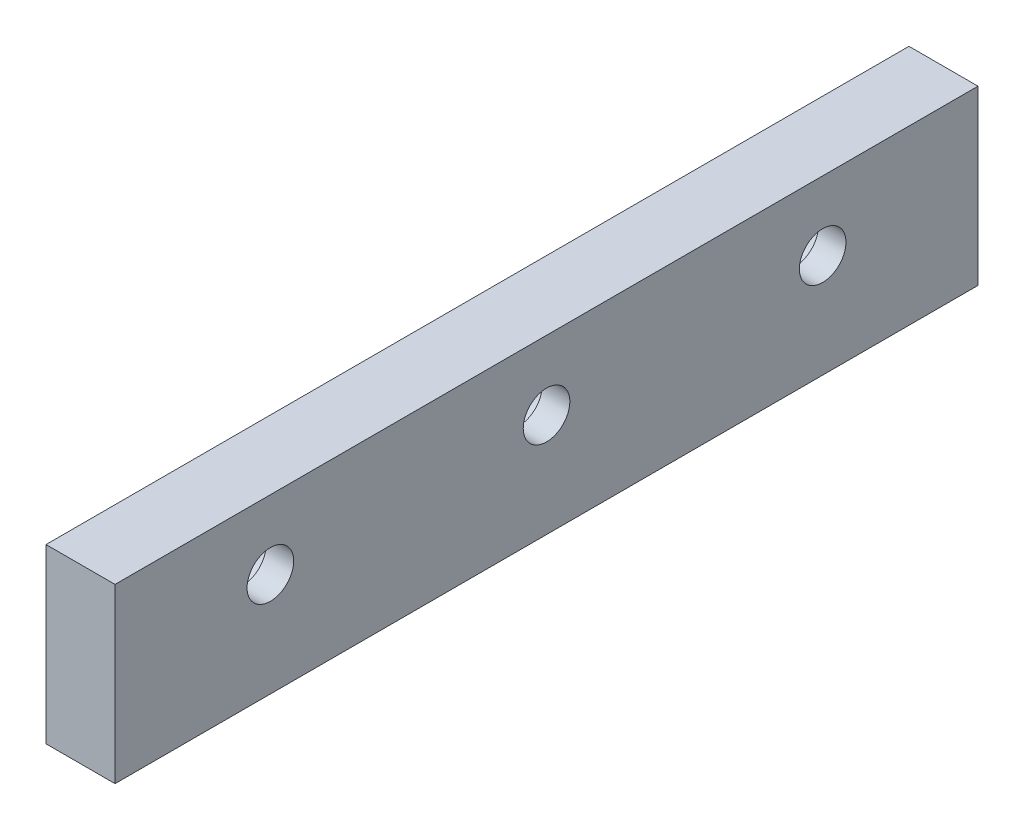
ISO-10303-21;
HEADER;
FILE_DESCRIPTION(('STEP AP214'),'2;1');
FILE_NAME('part.step','',(''),(''),'','','');
FILE_SCHEMA(('AUTOMOTIVE_DESIGN { 1 0 10303 214 1 1 1 1 }'));
ENDSEC;
DATA;
#1=APPLICATION_CONTEXT('core data for automotive mechanical design processes');
#2=APPLICATION_PROTOCOL_DEFINITION('international standard','automotive_design',2000,#1);
#3=PRODUCT_CONTEXT('',#1,'mechanical');
#4=PRODUCT('Part','Part','',(#3));
#5=PRODUCT_RELATED_PRODUCT_CATEGORY('part','',(#4));
#6=PRODUCT_DEFINITION_FORMATION('','',#4);
#7=PRODUCT_DEFINITION_CONTEXT('part definition',#1,'design');
#8=PRODUCT_DEFINITION('design','',#6,#7);
#9=PRODUCT_DEFINITION_SHAPE('','',#8);
#10=(LENGTH_UNIT() NAMED_UNIT(*) SI_UNIT(.MILLI.,.METRE.));
#11=(NAMED_UNIT(*) PLANE_ANGLE_UNIT() SI_UNIT($,.RADIAN.));
#12=(NAMED_UNIT(*) SI_UNIT($,.STERADIAN.) SOLID_ANGLE_UNIT());
#13=UNCERTAINTY_MEASURE_WITH_UNIT(LENGTH_MEASURE(1.E-05),#10,'distance_accuracy_value','');
#14=(GEOMETRIC_REPRESENTATION_CONTEXT(3) GLOBAL_UNCERTAINTY_ASSIGNED_CONTEXT((#13)) GLOBAL_UNIT_ASSIGNED_CONTEXT((#10,
#11,#12)) REPRESENTATION_CONTEXT('',''));
#15=CARTESIAN_POINT('',(0.,0.,0.));
#16=DIRECTION('',(0.,0.,1.));
#17=DIRECTION('',(1.,0.,0.));
#18=AXIS2_PLACEMENT_3D('',#15,#16,#17);
#19=CARTESIAN_POINT('',(-20.,20.,125.));
#20=DIRECTION('',(1.,0.,0.));
#21=DIRECTION('',(0.,1.,0.));
#22=AXIS2_PLACEMENT_3D('',#19,#20,#21);
#23=PLANE('',#22);
#24=CARTESIAN_POINT('',(-20.,0.,0.));
#25=DIRECTION('',(-1.,0.,0.));
#26=DIRECTION('',(0.,0.,1.));
#27=AXIS2_PLACEMENT_3D('',#24,#25,#26);
#28=CIRCLE('',#27,10.);
#29=CARTESIAN_POINT('',(-20.,0.,10.));
#30=VERTEX_POINT('',#29);
#31=EDGE_CURVE('E140',#30,#30,#28,.T.);
#32=ORIENTED_EDGE('',*,*,#31,.F.);
#33=EDGE_LOOP('',(#32));
#34=FACE_BOUND('',#33,.T.);
#35=CARTESIAN_POINT('',(-20.,0.,80.));
#36=DIRECTION('',(-1.,0.,0.));
#37=DIRECTION('',(0.,0.,1.));
#38=AXIS2_PLACEMENT_3D('',#35,#36,#37);
#39=CIRCLE('',#38,10.);
#40=CARTESIAN_POINT('',(-20.,0.,90.));
#41=VERTEX_POINT('',#40);
#42=EDGE_CURVE('E128',#41,#41,#39,.T.);
#43=ORIENTED_EDGE('',*,*,#42,.F.);
#44=EDGE_LOOP('',(#43));
#45=FACE_BOUND('',#44,.T.);
#46=CARTESIAN_POINT('',(-20.,0.,-80.));
#47=DIRECTION('',(-1.,0.,0.));
#48=DIRECTION('',(0.,0.,1.));
#49=AXIS2_PLACEMENT_3D('',#46,#47,#48);
#50=CIRCLE('',#49,10.);
#51=CARTESIAN_POINT('',(-20.,0.,-70.));
#52=VERTEX_POINT('',#51);
#53=EDGE_CURVE('E116',#52,#52,#50,.T.);
#54=ORIENTED_EDGE('',*,*,#53,.F.);
#55=EDGE_LOOP('',(#54));
#56=FACE_BOUND('',#55,.T.);
#57=DIRECTION('',(0.,-1.,0.));
#58=VECTOR('',#57,1.);
#59=CARTESIAN_POINT('',(-20.,20.,-125.));
#60=LINE('',#59,#58);
#61=CARTESIAN_POINT('',(-20.,20.,-125.));
#62=VERTEX_POINT('',#61);
#63=CARTESIAN_POINT('',(-20.,-30.,-125.));
#64=VERTEX_POINT('',#63);
#65=EDGE_CURVE('E94',#62,#64,#60,.T.);
#66=ORIENTED_EDGE('',*,*,#65,.T.);
#67=DIRECTION('',(0.,0.,-1.));
#68=VECTOR('',#67,1.);
#69=CARTESIAN_POINT('',(-20.,-30.,125.));
#70=LINE('',#69,#68);
#71=CARTESIAN_POINT('',(-20.,-30.,125.));
#72=VERTEX_POINT('',#71);
#73=EDGE_CURVE('E11',#72,#64,#70,.T.);
#74=ORIENTED_EDGE('',*,*,#73,.F.);
#75=DIRECTION('',(0.,-1.,0.));
#76=VECTOR('',#75,1.);
#77=CARTESIAN_POINT('',(-20.,20.,125.));
#78=LINE('',#77,#76);
#79=CARTESIAN_POINT('',(-20.,20.,125.));
#80=VERTEX_POINT('',#79);
#81=EDGE_CURVE('E82',#80,#72,#78,.T.);
#82=ORIENTED_EDGE('',*,*,#81,.F.);
#83=DIRECTION('',(0.,0.,-1.));
#84=VECTOR('',#83,1.);
#85=CARTESIAN_POINT('',(-20.,20.,125.));
#86=LINE('',#85,#84);
#87=EDGE_CURVE('E90',#80,#62,#86,.T.);
#88=ORIENTED_EDGE('',*,*,#87,.T.);
#89=EDGE_LOOP('',(#66,#74,#82,#88));
#90=FACE_BOUND('',#89,.T.);
#91=ADVANCED_FACE('F31',(#34,#45,#56,#90),#23,.F.);
#92=CARTESIAN_POINT('',(-20.,-30.,125.));
#93=DIRECTION('',(0.,1.,0.));
#94=DIRECTION('',(0.,0.,1.));
#95=AXIS2_PLACEMENT_3D('',#92,#93,#94);
#96=PLANE('',#95);
#97=DIRECTION('',(1.,0.,0.));
#98=VECTOR('',#97,1.);
#99=CARTESIAN_POINT('',(-20.,-30.,-125.));
#100=LINE('',#99,#98);
#101=CARTESIAN_POINT('',(0.,-30.,-125.));
#102=VERTEX_POINT('',#101);
#103=EDGE_CURVE('E86',#64,#102,#100,.T.);
#104=ORIENTED_EDGE('',*,*,#103,.T.);
#105=DIRECTION('',(0.,0.,-1.));
#106=VECTOR('',#105,1.);
#107=CARTESIAN_POINT('',(0.,-30.,125.));
#108=LINE('',#107,#106);
#109=CARTESIAN_POINT('',(0.,-30.,125.));
#110=VERTEX_POINT('',#109);
#111=EDGE_CURVE('E39',#110,#102,#108,.T.);
#112=ORIENTED_EDGE('',*,*,#111,.F.);
#113=DIRECTION('',(1.,0.,0.));
#114=VECTOR('',#113,1.);
#115=CARTESIAN_POINT('',(-20.,-30.,125.));
#116=LINE('',#115,#114);
#117=EDGE_CURVE('E77',#72,#110,#116,.T.);
#118=ORIENTED_EDGE('',*,*,#117,.F.);
#119=ORIENTED_EDGE('',*,*,#73,.T.);
#120=EDGE_LOOP('',(#104,#112,#118,#119));
#121=FACE_BOUND('',#120,.T.);
#122=ADVANCED_FACE('F85',(#121),#96,.F.);
#123=CARTESIAN_POINT('',(0.,20.,125.));
#124=DIRECTION('',(-1.,0.,0.));
#125=DIRECTION('',(0.,-1.,0.));
#126=AXIS2_PLACEMENT_3D('',#123,#124,#125);
#127=PLANE('',#126);
#128=CARTESIAN_POINT('',(0.,0.,0.));
#129=DIRECTION('',(-1.,0.,0.));
#130=DIRECTION('',(0.,0.,1.));
#131=AXIS2_PLACEMENT_3D('',#128,#129,#130);
#132=CIRCLE('',#131,6.75);
#133=CARTESIAN_POINT('',(0.,0.,6.75));
#134=VERTEX_POINT('',#133);
#135=EDGE_CURVE('E131',#134,#134,#132,.T.);
#136=ORIENTED_EDGE('',*,*,#135,.T.);
#137=EDGE_LOOP('',(#136));
#138=FACE_BOUND('',#137,.T.);
#139=CARTESIAN_POINT('',(0.,0.,80.));
#140=DIRECTION('',(-1.,0.,0.));
#141=DIRECTION('',(0.,0.,1.));
#142=AXIS2_PLACEMENT_3D('',#139,#140,#141);
#143=CIRCLE('',#142,6.75);
#144=CARTESIAN_POINT('',(0.,0.,86.75));
#145=VERTEX_POINT('',#144);
#146=EDGE_CURVE('E119',#145,#145,#143,.T.);
#147=ORIENTED_EDGE('',*,*,#146,.T.);
#148=EDGE_LOOP('',(#147));
#149=FACE_BOUND('',#148,.T.);
#150=CARTESIAN_POINT('',(0.,0.,-80.));
#151=DIRECTION('',(-1.,0.,0.));
#152=DIRECTION('',(0.,0.,1.));
#153=AXIS2_PLACEMENT_3D('',#150,#151,#152);
#154=CIRCLE('',#153,6.75);
#155=CARTESIAN_POINT('',(0.,0.,-73.25));
#156=VERTEX_POINT('',#155);
#157=EDGE_CURVE('E97',#156,#156,#154,.T.);
#158=ORIENTED_EDGE('',*,*,#157,.T.);
#159=EDGE_LOOP('',(#158));
#160=FACE_BOUND('',#159,.T.);
#161=DIRECTION('',(0.,1.,0.));
#162=VECTOR('',#161,1.);
#163=CARTESIAN_POINT('',(0.,20.,-125.));
#164=LINE('',#163,#162);
#165=CARTESIAN_POINT('',(0.,20.,-125.));
#166=VERTEX_POINT('',#165);
#167=EDGE_CURVE('E64',#102,#166,#164,.T.);
#168=ORIENTED_EDGE('',*,*,#167,.T.);
#169=DIRECTION('',(0.,0.,-1.));
#170=VECTOR('',#169,1.);
#171=CARTESIAN_POINT('',(0.,20.,125.));
#172=LINE('',#171,#170);
#173=CARTESIAN_POINT('',(0.,20.,125.));
#174=VERTEX_POINT('',#173);
#175=EDGE_CURVE('E87',#174,#166,#172,.T.);
#176=ORIENTED_EDGE('',*,*,#175,.F.);
#177=DIRECTION('',(0.,1.,0.));
#178=VECTOR('',#177,1.);
#179=CARTESIAN_POINT('',(0.,20.,125.));
#180=LINE('',#179,#178);
#181=EDGE_CURVE('E80',#110,#174,#180,.T.);
#182=ORIENTED_EDGE('',*,*,#181,.F.);
#183=ORIENTED_EDGE('',*,*,#111,.T.);
#184=EDGE_LOOP('',(#168,#176,#182,#183));
#185=FACE_BOUND('',#184,.T.);
#186=ADVANCED_FACE('F88',(#138,#149,#160,#185),#127,.F.);
#187=CARTESIAN_POINT('',(-20.,20.,125.));
#188=DIRECTION('',(0.,-1.,0.));
#189=DIRECTION('',(1.,0.,0.));
#190=AXIS2_PLACEMENT_3D('',#187,#188,#189);
#191=PLANE('',#190);
#192=DIRECTION('',(-1.,0.,0.));
#193=VECTOR('',#192,1.);
#194=CARTESIAN_POINT('',(-20.,20.,-125.));
#195=LINE('',#194,#193);
#196=EDGE_CURVE('E70',#166,#62,#195,.T.);
#197=ORIENTED_EDGE('',*,*,#196,.T.);
#198=ORIENTED_EDGE('',*,*,#87,.F.);
#199=DIRECTION('',(-1.,0.,0.));
#200=VECTOR('',#199,1.);
#201=CARTESIAN_POINT('',(-20.,20.,125.));
#202=LINE('',#201,#200);
#203=EDGE_CURVE('E47',#174,#80,#202,.T.);
#204=ORIENTED_EDGE('',*,*,#203,.F.);
#205=ORIENTED_EDGE('',*,*,#175,.T.);
#206=EDGE_LOOP('',(#197,#198,#204,#205));
#207=FACE_BOUND('',#206,.T.);
#208=ADVANCED_FACE('F102',(#207),#191,.F.);
#209=CARTESIAN_POINT('',(-20.,-30.,125.));
#210=DIRECTION('',(0.,0.,1.));
#211=DIRECTION('',(1.,0.,0.));
#212=AXIS2_PLACEMENT_3D('',#209,#210,#211);
#213=PLANE('',#212);
#214=ORIENTED_EDGE('',*,*,#81,.T.);
#215=ORIENTED_EDGE('',*,*,#117,.T.);
#216=ORIENTED_EDGE('',*,*,#181,.T.);
#217=ORIENTED_EDGE('',*,*,#203,.T.);
#218=EDGE_LOOP('',(#214,#215,#216,#217));
#219=FACE_BOUND('',#218,.T.);
#220=ADVANCED_FACE('F78',(#219),#213,.T.);
#221=CARTESIAN_POINT('',(-20.,-30.,-125.));
#222=DIRECTION('',(0.,0.,1.));
#223=DIRECTION('',(1.,0.,0.));
#224=AXIS2_PLACEMENT_3D('',#221,#222,#223);
#225=PLANE('',#224);
#226=ORIENTED_EDGE('',*,*,#65,.F.);
#227=ORIENTED_EDGE('',*,*,#196,.F.);
#228=ORIENTED_EDGE('',*,*,#167,.F.);
#229=ORIENTED_EDGE('',*,*,#103,.F.);
#230=EDGE_LOOP('',(#226,#227,#228,#229));
#231=FACE_BOUND('',#230,.T.);
#232=ADVANCED_FACE('F105',(#231),#225,.F.);
#233=CARTESIAN_POINT('',(-20.,0.,-80.));
#234=DIRECTION('',(-1.,0.,0.));
#235=DIRECTION('',(0.,0.,1.));
#236=AXIS2_PLACEMENT_3D('',#233,#234,#235);
#237=CYLINDRICAL_SURFACE('',#236,6.75);
#238=ORIENTED_EDGE('',*,*,#157,.F.);
#239=EDGE_LOOP('',(#238));
#240=FACE_BOUND('',#239,.T.);
#241=CARTESIAN_POINT('',(-8.,0.,-80.));
#242=DIRECTION('',(-1.,0.,0.));
#243=DIRECTION('',(0.,0.,1.));
#244=AXIS2_PLACEMENT_3D('',#241,#242,#243);
#245=CIRCLE('',#244,6.75);
#246=CARTESIAN_POINT('',(-8.,0.,-73.25));
#247=VERTEX_POINT('',#246);
#248=EDGE_CURVE('E110',#247,#247,#245,.T.);
#249=ORIENTED_EDGE('',*,*,#248,.T.);
#250=EDGE_LOOP('',(#249));
#251=FACE_BOUND('',#250,.T.);
#252=ADVANCED_FACE('F165',(#240,#251),#237,.F.);
#253=CARTESIAN_POINT('',(-8.,6.75,-80.));
#254=DIRECTION('',(1.,0.,0.));
#255=DIRECTION('',(0.,0.,-1.));
#256=AXIS2_PLACEMENT_3D('',#253,#254,#255);
#257=PLANE('',#256);
#258=ORIENTED_EDGE('',*,*,#248,.F.);
#259=EDGE_LOOP('',(#258));
#260=FACE_BOUND('',#259,.T.);
#261=CARTESIAN_POINT('',(-8.,0.,-80.));
#262=DIRECTION('',(-1.,0.,0.));
#263=DIRECTION('',(0.,0.,1.));
#264=AXIS2_PLACEMENT_3D('',#261,#262,#263);
#265=CIRCLE('',#264,10.);
#266=CARTESIAN_POINT('',(-8.,0.,-70.));
#267=VERTEX_POINT('',#266);
#268=EDGE_CURVE('E113',#267,#267,#265,.T.);
#269=ORIENTED_EDGE('',*,*,#268,.T.);
#270=EDGE_LOOP('',(#269));
#271=FACE_BOUND('',#270,.T.);
#272=ADVANCED_FACE('F155',(#260,#271),#257,.F.);
#273=CARTESIAN_POINT('',(-20.,0.,-80.));
#274=DIRECTION('',(-1.,0.,0.));
#275=DIRECTION('',(0.,0.,1.));
#276=AXIS2_PLACEMENT_3D('',#273,#274,#275);
#277=CYLINDRICAL_SURFACE('',#276,10.);
#278=ORIENTED_EDGE('',*,*,#268,.F.);
#279=EDGE_LOOP('',(#278));
#280=FACE_BOUND('',#279,.T.);
#281=ORIENTED_EDGE('',*,*,#53,.T.);
#282=EDGE_LOOP('',(#281));
#283=FACE_BOUND('',#282,.T.);
#284=ADVANCED_FACE('F152',(#280,#283),#277,.F.);
#285=CARTESIAN_POINT('',(-20.,0.,80.));
#286=DIRECTION('',(-1.,0.,0.));
#287=DIRECTION('',(0.,0.,1.));
#288=AXIS2_PLACEMENT_3D('',#285,#286,#287);
#289=CYLINDRICAL_SURFACE('',#288,6.75);
#290=ORIENTED_EDGE('',*,*,#146,.F.);
#291=EDGE_LOOP('',(#290));
#292=FACE_BOUND('',#291,.T.);
#293=CARTESIAN_POINT('',(-8.,0.,80.));
#294=DIRECTION('',(-1.,0.,0.));
#295=DIRECTION('',(0.,0.,1.));
#296=AXIS2_PLACEMENT_3D('',#293,#294,#295);
#297=CIRCLE('',#296,6.75);
#298=CARTESIAN_POINT('',(-8.,0.,86.75));
#299=VERTEX_POINT('',#298);
#300=EDGE_CURVE('E122',#299,#299,#297,.T.);
#301=ORIENTED_EDGE('',*,*,#300,.T.);
#302=EDGE_LOOP('',(#301));
#303=FACE_BOUND('',#302,.T.);
#304=ADVANCED_FACE('F154',(#292,#303),#289,.F.);
#305=CARTESIAN_POINT('',(-8.,6.75,80.));
#306=DIRECTION('',(1.,0.,0.));
#307=DIRECTION('',(0.,0.,-1.));
#308=AXIS2_PLACEMENT_3D('',#305,#306,#307);
#309=PLANE('',#308);
#310=ORIENTED_EDGE('',*,*,#300,.F.);
#311=EDGE_LOOP('',(#310));
#312=FACE_BOUND('',#311,.T.);
#313=CARTESIAN_POINT('',(-8.,0.,80.));
#314=DIRECTION('',(-1.,0.,0.));
#315=DIRECTION('',(0.,0.,1.));
#316=AXIS2_PLACEMENT_3D('',#313,#314,#315);
#317=CIRCLE('',#316,10.);
#318=CARTESIAN_POINT('',(-8.,0.,90.));
#319=VERTEX_POINT('',#318);
#320=EDGE_CURVE('E125',#319,#319,#317,.T.);
#321=ORIENTED_EDGE('',*,*,#320,.T.);
#322=EDGE_LOOP('',(#321));
#323=FACE_BOUND('',#322,.T.);
#324=ADVANCED_FACE('F162',(#312,#323),#309,.F.);
#325=CARTESIAN_POINT('',(-20.,0.,80.));
#326=DIRECTION('',(-1.,0.,0.));
#327=DIRECTION('',(0.,0.,1.));
#328=AXIS2_PLACEMENT_3D('',#325,#326,#327);
#329=CYLINDRICAL_SURFACE('',#328,10.);
#330=ORIENTED_EDGE('',*,*,#320,.F.);
#331=EDGE_LOOP('',(#330));
#332=FACE_BOUND('',#331,.T.);
#333=ORIENTED_EDGE('',*,*,#42,.T.);
#334=EDGE_LOOP('',(#333));
#335=FACE_BOUND('',#334,.T.);
#336=ADVANCED_FACE('F230',(#332,#335),#329,.F.);
#337=CARTESIAN_POINT('',(-20.,0.,0.));
#338=DIRECTION('',(-1.,0.,0.));
#339=DIRECTION('',(0.,0.,1.));
#340=AXIS2_PLACEMENT_3D('',#337,#338,#339);
#341=CYLINDRICAL_SURFACE('',#340,6.75);
#342=ORIENTED_EDGE('',*,*,#135,.F.);
#343=EDGE_LOOP('',(#342));
#344=FACE_BOUND('',#343,.T.);
#345=CARTESIAN_POINT('',(-8.,0.,0.));
#346=DIRECTION('',(-1.,0.,0.));
#347=DIRECTION('',(0.,0.,1.));
#348=AXIS2_PLACEMENT_3D('',#345,#346,#347);
#349=CIRCLE('',#348,6.75);
#350=CARTESIAN_POINT('',(-8.,0.,6.75));
#351=VERTEX_POINT('',#350);
#352=EDGE_CURVE('E134',#351,#351,#349,.T.);
#353=ORIENTED_EDGE('',*,*,#352,.T.);
#354=EDGE_LOOP('',(#353));
#355=FACE_BOUND('',#354,.T.);
#356=ADVANCED_FACE('F239',(#344,#355),#341,.F.);
#357=CARTESIAN_POINT('',(-8.,6.75,0.));
#358=DIRECTION('',(1.,0.,0.));
#359=DIRECTION('',(0.,0.,-1.));
#360=AXIS2_PLACEMENT_3D('',#357,#358,#359);
#361=PLANE('',#360);
#362=ORIENTED_EDGE('',*,*,#352,.F.);
#363=EDGE_LOOP('',(#362));
#364=FACE_BOUND('',#363,.T.);
#365=CARTESIAN_POINT('',(-8.,0.,0.));
#366=DIRECTION('',(-1.,0.,0.));
#367=DIRECTION('',(0.,0.,1.));
#368=AXIS2_PLACEMENT_3D('',#365,#366,#367);
#369=CIRCLE('',#368,10.);
#370=CARTESIAN_POINT('',(-8.,0.,10.));
#371=VERTEX_POINT('',#370);
#372=EDGE_CURVE('E137',#371,#371,#369,.T.);
#373=ORIENTED_EDGE('',*,*,#372,.T.);
#374=EDGE_LOOP('',(#373));
#375=FACE_BOUND('',#374,.T.);
#376=ADVANCED_FACE('F249',(#364,#375),#361,.F.);
#377=CARTESIAN_POINT('',(-20.,0.,0.));
#378=DIRECTION('',(-1.,0.,0.));
#379=DIRECTION('',(0.,0.,1.));
#380=AXIS2_PLACEMENT_3D('',#377,#378,#379);
#381=CYLINDRICAL_SURFACE('',#380,10.);
#382=ORIENTED_EDGE('',*,*,#372,.F.);
#383=EDGE_LOOP('',(#382));
#384=FACE_BOUND('',#383,.T.);
#385=ORIENTED_EDGE('',*,*,#31,.T.);
#386=EDGE_LOOP('',(#385));
#387=FACE_BOUND('',#386,.T.);
#388=ADVANCED_FACE('F144',(#384,#387),#381,.F.);
#389=CLOSED_SHELL('',(#91,#122,#186,#208,#220,#232,#252,#272,#284,#304,#324,#336,#356,#376,#388));
#390=MANIFOLD_SOLID_BREP('B2',#389);
#391=ADVANCED_BREP_SHAPE_REPRESENTATION('',(#18,#390),#14);
#392=SHAPE_DEFINITION_REPRESENTATION(#9,#391);
ENDSEC;
END-ISO-10303-21;
